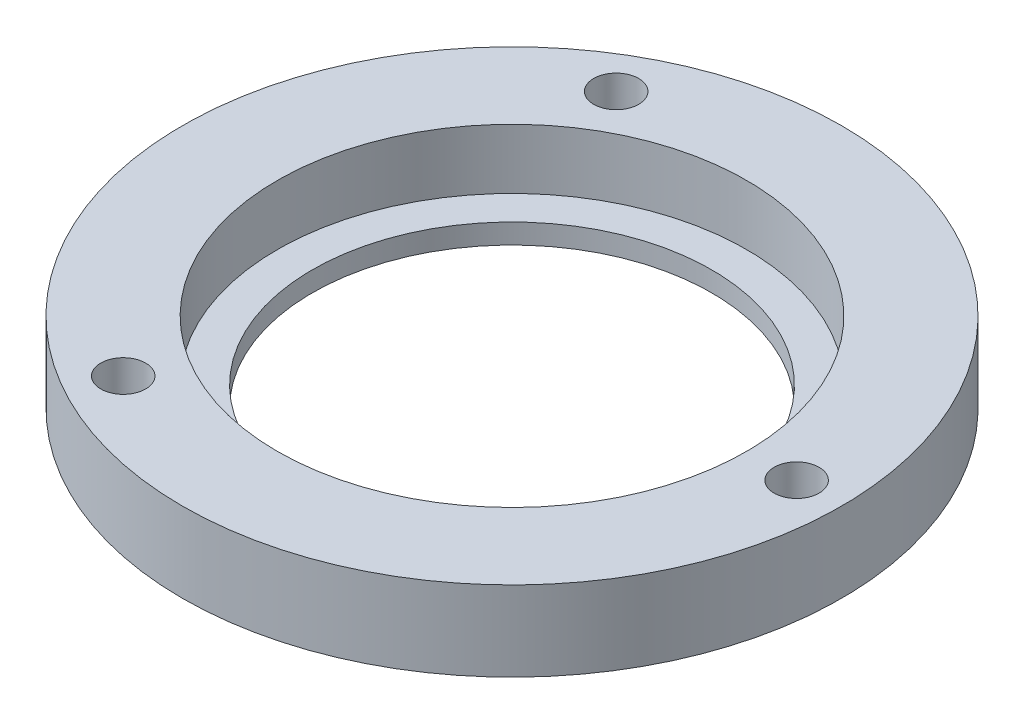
from build123d import *

# Parameters (mm, degrees)
CHAMBRAGE_POUR_VIS_T_TE_CYLINDRIQUE_D           = 4.5
CHAMBRAGE_POUR_VIS_T_TE_CYLINDRIQUE_CBORE_D     = 8
CHAMBRAGE_POUR_VIS_T_TE_CYLINDRIQUE_CBORE_DEPTH = 4
R_P_TITION_CIRCULAIRE1_COUNT                    = 3


with BuildPart() as part:
    # Esquisse1 → R_volution1 (revolve)
    with BuildSketch(Plane.XY, mode=Mode.PRIVATE) as r_volution1_sk:
        Polygon((20, 2), (20, 0), (33, 0), (33, 8), (23.5, 8), (23.5, 2), align=None)
    revolve(r_volution1_sk.sketch.rotate(Axis((0, 31.17754591, 0), (0, -1, 0)), 90), axis=Axis((0, 31.17754591, 0), (0, -1, 0)))

    # Chambrage pour vis _ t_te cylindrique (through all)
    with Locations(Plane.XZ):
        with Locations((28.5, 0)):
            chambrage_pour_vis_t_te_cylindrique = CounterBoreHole(CHAMBRAGE_POUR_VIS_T_TE_CYLINDRIQUE_D / 2, CHAMBRAGE_POUR_VIS_T_TE_CYLINDRIQUE_CBORE_D / 2, CHAMBRAGE_POUR_VIS_T_TE_CYLINDRIQUE_CBORE_DEPTH)

    # R_p_tition circulaire1: Chambrage pour vis _ t_te cylindrique ×3 about axis
    r_p_tition_circulaire1_axis = Axis((0, 0, 0), (0, 1, 0))
    for i in range(1, R_P_TITION_CIRCULAIRE1_COUNT):
        add(chambrage_pour_vis_t_te_cylindrique.rotate(r_p_tition_circulaire1_axis, i * 360 / R_P_TITION_CIRCULAIRE1_COUNT), mode=Mode.SUBTRACT)


solid = part.part
